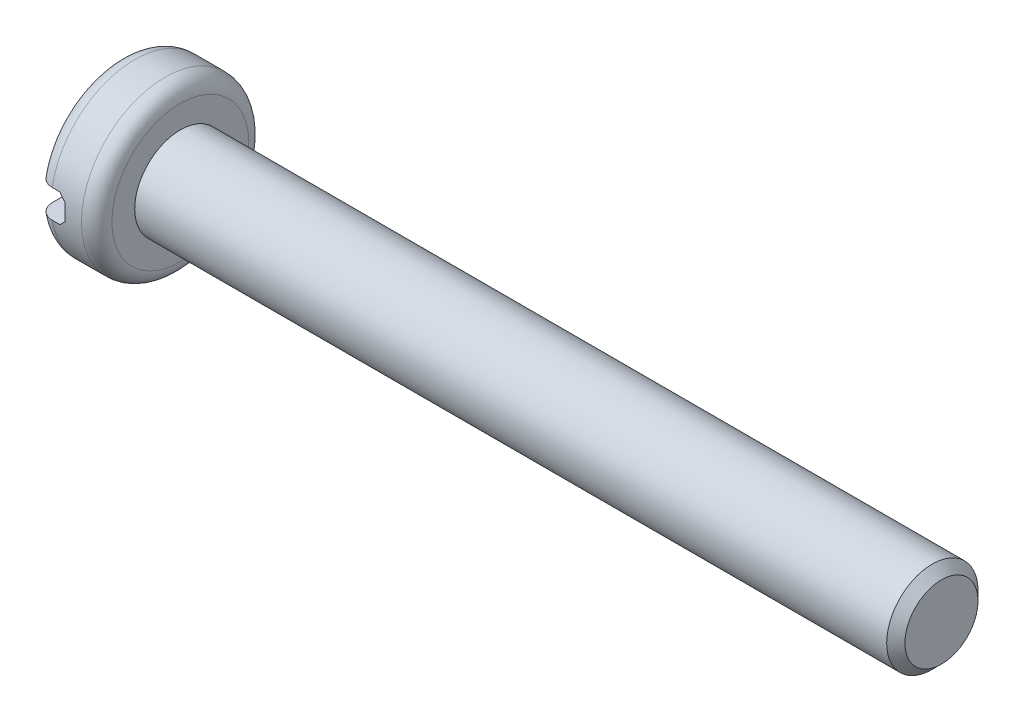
ISO-10303-21;
HEADER;
FILE_DESCRIPTION(('STEP AP214'),'2;1');
FILE_NAME('part.step','',(''),(''),'','','');
FILE_SCHEMA(('AUTOMOTIVE_DESIGN { 1 0 10303 214 1 1 1 1 }'));
ENDSEC;
DATA;
#1=APPLICATION_CONTEXT('core data for automotive mechanical design processes');
#2=APPLICATION_PROTOCOL_DEFINITION('international standard','automotive_design',2000,#1);
#3=PRODUCT_CONTEXT('',#1,'mechanical');
#4=PRODUCT('Part','Part','',(#3));
#5=PRODUCT_RELATED_PRODUCT_CATEGORY('part','',(#4));
#6=PRODUCT_DEFINITION_FORMATION('','',#4);
#7=PRODUCT_DEFINITION_CONTEXT('part definition',#1,'design');
#8=PRODUCT_DEFINITION('design','',#6,#7);
#9=PRODUCT_DEFINITION_SHAPE('','',#8);
#10=(LENGTH_UNIT() NAMED_UNIT(*) SI_UNIT(.MILLI.,.METRE.));
#11=(NAMED_UNIT(*) PLANE_ANGLE_UNIT() SI_UNIT($,.RADIAN.));
#12=(NAMED_UNIT(*) SI_UNIT($,.STERADIAN.) SOLID_ANGLE_UNIT());
#13=UNCERTAINTY_MEASURE_WITH_UNIT(LENGTH_MEASURE(1.E-05),#10,'distance_accuracy_value','');
#14=(GEOMETRIC_REPRESENTATION_CONTEXT(3) GLOBAL_UNCERTAINTY_ASSIGNED_CONTEXT((#13)) GLOBAL_UNIT_ASSIGNED_CONTEXT((#10,
#11,#12)) REPRESENTATION_CONTEXT('',''));
#15=CARTESIAN_POINT('',(0.,0.,0.));
#16=DIRECTION('',(0.,0.,1.));
#17=DIRECTION('',(1.,0.,0.));
#18=AXIS2_PLACEMENT_3D('',#15,#16,#17);
#19=CARTESIAN_POINT('',(0.,0.,0.));
#20=DIRECTION('',(1.,0.,0.));
#21=DIRECTION('',(0.,0.,-1.));
#22=AXIS2_PLACEMENT_3D('',#19,#20,#21);
#23=PLANE('',#22);
#24=DIRECTION('',(0.,0.,1.));
#25=VECTOR('',#24,1.);
#26=CARTESIAN_POINT('',(0.,0.465549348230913,-5.));
#27=LINE('',#26,#25);
#28=CARTESIAN_POINT('',(0.,0.465549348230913,-2.20130956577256));
#29=VERTEX_POINT('',#28);
#30=CARTESIAN_POINT('',(0.,0.465549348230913,2.20130956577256));
#31=VERTEX_POINT('',#30);
#32=EDGE_CURVE('E138',#29,#31,#27,.T.);
#33=ORIENTED_EDGE('',*,*,#32,.T.);
#34=CARTESIAN_POINT('',(0.,0.,0.));
#35=DIRECTION('',(1.,0.,0.));
#36=DIRECTION('',(0.,0.,-1.));
#37=AXIS2_PLACEMENT_3D('',#34,#35,#36);
#38=CIRCLE('',#37,2.25);
#39=EDGE_CURVE('E231',#31,#29,#38,.F.);
#40=ORIENTED_EDGE('',*,*,#39,.T.);
#41=EDGE_LOOP('',(#33,#40));
#42=FACE_BOUND('',#41,.T.);
#43=ADVANCED_FACE('F33',(#42),#23,.F.);
#44=DIRECTION('',(0.,0.,1.));
#45=VECTOR('',#44,1.);
#46=CARTESIAN_POINT('',(0.,-0.465549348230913,-5.));
#47=LINE('',#46,#45);
#48=CARTESIAN_POINT('',(0.,-0.465549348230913,-2.20130956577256));
#49=VERTEX_POINT('',#48);
#50=CARTESIAN_POINT('',(0.,-0.465549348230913,2.20130956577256));
#51=VERTEX_POINT('',#50);
#52=EDGE_CURVE('E124',#49,#51,#47,.T.);
#53=ORIENTED_EDGE('',*,*,#52,.F.);
#54=CARTESIAN_POINT('',(0.,0.,0.));
#55=DIRECTION('',(1.,0.,0.));
#56=DIRECTION('',(0.,0.,-1.));
#57=AXIS2_PLACEMENT_3D('',#54,#55,#56);
#58=CIRCLE('',#57,2.25);
#59=EDGE_CURVE('E180',#49,#51,#58,.F.);
#60=ORIENTED_EDGE('',*,*,#59,.T.);
#61=EDGE_LOOP('',(#53,#60));
#62=FACE_BOUND('',#61,.T.);
#63=ADVANCED_FACE('F209',(#62),#23,.F.);
#64=CARTESIAN_POINT('',(0.,0.,0.));
#65=DIRECTION('',(-1.,0.,0.));
#66=DIRECTION('',(0.,0.,1.));
#67=AXIS2_PLACEMENT_3D('',#64,#65,#66);
#68=CYLINDRICAL_SURFACE('',#67,2.75);
#69=CARTESIAN_POINT('',(1.5,0.,0.));
#70=DIRECTION('',(-1.,0.,0.));
#71=DIRECTION('',(0.,0.,1.));
#72=AXIS2_PLACEMENT_3D('',#69,#70,#71);
#73=CIRCLE('',#72,2.75);
#74=CARTESIAN_POINT('',(1.5,0.,2.75));
#75=VERTEX_POINT('',#74);
#76=EDGE_CURVE('E174',#75,#75,#73,.T.);
#77=ORIENTED_EDGE('',*,*,#76,.T.);
#78=EDGE_LOOP('',(#77));
#79=FACE_BOUND('',#78,.T.);
#80=DIRECTION('',(-1.,0.,0.));
#81=VECTOR('',#80,1.);
#82=CARTESIAN_POINT('',(0.,-0.465549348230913,2.71030695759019));
#83=LINE('',#82,#81);
#84=CARTESIAN_POINT('',(0.753445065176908,-0.465549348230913,2.71030695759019));
#85=VERTEX_POINT('',#84);
#86=CARTESIAN_POINT('',(0.5,-0.465549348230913,2.71030695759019));
#87=VERTEX_POINT('',#86);
#88=EDGE_CURVE('E103',#85,#87,#83,.T.);
#89=ORIENTED_EDGE('',*,*,#88,.T.);
#90=CARTESIAN_POINT('',(0.5,0.,0.));
#91=DIRECTION('',(1.,0.,0.));
#92=DIRECTION('',(0.,0.,-1.));
#93=AXIS2_PLACEMENT_3D('',#90,#91,#92);
#94=CIRCLE('',#93,2.75);
#95=CARTESIAN_POINT('',(0.5,-0.465549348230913,-2.71030695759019));
#96=VERTEX_POINT('',#95);
#97=EDGE_CURVE('E172',#87,#96,#94,.T.);
#98=ORIENTED_EDGE('',*,*,#97,.T.);
#99=DIRECTION('',(-1.,0.,0.));
#100=VECTOR('',#99,1.);
#101=CARTESIAN_POINT('',(0.,-0.465549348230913,-2.71030695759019));
#102=LINE('',#101,#100);
#103=CARTESIAN_POINT('',(0.753445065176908,-0.465549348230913,-2.71030695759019));
#104=VERTEX_POINT('',#103);
#105=EDGE_CURVE('E135',#96,#104,#102,.F.);
#106=ORIENTED_EDGE('',*,*,#105,.T.);
#107=CARTESIAN_POINT('',(1.21899441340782,0.,0.));
#108=DIRECTION('',(0.707106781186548,-0.707106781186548,0.));
#109=DIRECTION('',(-0.707106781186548,-0.707106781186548,0.));
#110=AXIS2_PLACEMENT_3D('',#107,#108,#109);
#111=ELLIPSE('',#110,3.88908729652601,2.75);
#112=CARTESIAN_POINT('',(0.953445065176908,-0.265549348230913,-2.7371487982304));
#113=VERTEX_POINT('',#112);
#114=EDGE_CURVE('E122',#104,#113,#111,.T.);
#115=ORIENTED_EDGE('',*,*,#114,.T.);
#116=CARTESIAN_POINT('',(0.953445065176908,0.,0.));
#117=DIRECTION('',(1.,0.,0.));
#118=DIRECTION('',(0.,0.,-1.));
#119=AXIS2_PLACEMENT_3D('',#116,#117,#118);
#120=CIRCLE('',#119,2.75);
#121=CARTESIAN_POINT('',(0.953445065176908,0.265549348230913,-2.7371487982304));
#122=VERTEX_POINT('',#121);
#123=EDGE_CURVE('E133',#113,#122,#120,.T.);
#124=ORIENTED_EDGE('',*,*,#123,.T.);
#125=CARTESIAN_POINT('',(1.21899441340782,0.,0.));
#126=DIRECTION('',(0.707106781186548,0.707106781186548,0.));
#127=DIRECTION('',(-0.707106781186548,0.707106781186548,0.));
#128=AXIS2_PLACEMENT_3D('',#125,#126,#127);
#129=ELLIPSE('',#128,3.88908729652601,2.75);
#130=CARTESIAN_POINT('',(0.753445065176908,0.465549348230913,-2.71030695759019));
#131=VERTEX_POINT('',#130);
#132=EDGE_CURVE('E137',#122,#131,#129,.T.);
#133=ORIENTED_EDGE('',*,*,#132,.T.);
#134=DIRECTION('',(-1.,0.,0.));
#135=VECTOR('',#134,1.);
#136=CARTESIAN_POINT('',(0.,0.465549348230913,-2.71030695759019));
#137=LINE('',#136,#135);
#138=CARTESIAN_POINT('',(0.5,0.465549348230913,-2.71030695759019));
#139=VERTEX_POINT('',#138);
#140=EDGE_CURVE('E115',#131,#139,#137,.T.);
#141=ORIENTED_EDGE('',*,*,#140,.T.);
#142=CARTESIAN_POINT('',(0.5,0.,0.));
#143=DIRECTION('',(1.,0.,0.));
#144=DIRECTION('',(0.,0.,-1.));
#145=AXIS2_PLACEMENT_3D('',#142,#143,#144);
#146=CIRCLE('',#145,2.75);
#147=CARTESIAN_POINT('',(0.5,0.465549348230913,2.71030695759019));
#148=VERTEX_POINT('',#147);
#149=EDGE_CURVE('E170',#139,#148,#146,.T.);
#150=ORIENTED_EDGE('',*,*,#149,.T.);
#151=DIRECTION('',(-1.,0.,0.));
#152=VECTOR('',#151,1.);
#153=CARTESIAN_POINT('',(0.,0.465549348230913,2.71030695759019));
#154=LINE('',#153,#152);
#155=CARTESIAN_POINT('',(0.753445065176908,0.465549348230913,2.71030695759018));
#156=VERTEX_POINT('',#155);
#157=EDGE_CURVE('E150',#148,#156,#154,.F.);
#158=ORIENTED_EDGE('',*,*,#157,.T.);
#159=CARTESIAN_POINT('',(0.953445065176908,0.265549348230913,2.7371487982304));
#160=VERTEX_POINT('',#159);
#161=EDGE_CURVE('E131',#156,#160,#129,.T.);
#162=ORIENTED_EDGE('',*,*,#161,.T.);
#163=CARTESIAN_POINT('',(0.953445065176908,-0.265549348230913,2.7371487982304));
#164=VERTEX_POINT('',#163);
#165=EDGE_CURVE('E129',#160,#164,#120,.T.);
#166=ORIENTED_EDGE('',*,*,#165,.T.);
#167=EDGE_CURVE('E114',#164,#85,#111,.T.);
#168=ORIENTED_EDGE('',*,*,#167,.T.);
#169=EDGE_LOOP('',(#89,#98,#106,#115,#124,#133,#141,#150,#158,#162,#166,#168));
#170=FACE_BOUND('',#169,.T.);
#171=ADVANCED_FACE('F127',(#79,#170),#68,.T.);
#172=CARTESIAN_POINT('',(2.,2.75,0.));
#173=DIRECTION('',(-1.,0.,0.));
#174=DIRECTION('',(0.,0.,1.));
#175=AXIS2_PLACEMENT_3D('',#172,#173,#174);
#176=PLANE('',#175);
#177=CARTESIAN_POINT('',(2.,0.,0.));
#178=DIRECTION('',(-1.,0.,0.));
#179=DIRECTION('',(0.,0.,1.));
#180=AXIS2_PLACEMENT_3D('',#177,#178,#179);
#181=CIRCLE('',#180,2.25);
#182=CARTESIAN_POINT('',(2.,0.,2.25));
#183=VERTEX_POINT('',#182);
#184=EDGE_CURVE('E177',#183,#183,#181,.F.);
#185=ORIENTED_EDGE('',*,*,#184,.T.);
#186=EDGE_LOOP('',(#185));
#187=FACE_BOUND('',#186,.T.);
#188=CARTESIAN_POINT('',(2.,0.,0.));
#189=DIRECTION('',(-1.,0.,0.));
#190=DIRECTION('',(0.,0.,1.));
#191=AXIS2_PLACEMENT_3D('',#188,#189,#190);
#192=CIRCLE('',#191,1.5);
#193=CARTESIAN_POINT('',(2.,0.,1.5));
#194=VERTEX_POINT('',#193);
#195=EDGE_CURVE('E159',#194,#194,#192,.F.);
#196=ORIENTED_EDGE('',*,*,#195,.F.);
#197=EDGE_LOOP('',(#196));
#198=FACE_BOUND('',#197,.T.);
#199=ADVANCED_FACE('F202',(#187,#198),#176,.F.);
#200=CARTESIAN_POINT('',(0.,0.465549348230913,-5.));
#201=DIRECTION('',(0.,1.,0.));
#202=DIRECTION('',(0.,0.,1.));
#203=AXIS2_PLACEMENT_3D('',#200,#201,#202);
#204=PLANE('',#203);
#205=ORIENTED_EDGE('',*,*,#32,.F.);
#206=CARTESIAN_POINT('',(0.,0.465549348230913,-2.20130956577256));
#207=CARTESIAN_POINT('',(-2.32271709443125E-05,0.465549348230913,-2.23036705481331));
#208=CARTESIAN_POINT('',(0.00242337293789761,0.465549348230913,-2.25942426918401));
#209=CARTESIAN_POINT('',(0.0121175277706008,0.465549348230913,-2.31672486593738));
#210=CARTESIAN_POINT('',(0.0193648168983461,0.465549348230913,-2.34496829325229));
#211=CARTESIAN_POINT('',(0.0385299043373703,0.465549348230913,-2.39985498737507));
#212=CARTESIAN_POINT('',(0.0504517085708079,0.465549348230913,-2.42649685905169));
#213=CARTESIAN_POINT('',(0.0786500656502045,0.465549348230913,-2.47735490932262));
#214=CARTESIAN_POINT('',(0.0949247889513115,0.465549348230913,-2.50157210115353));
#215=CARTESIAN_POINT('',(0.131159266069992,0.465549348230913,-2.54656669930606));
#216=CARTESIAN_POINT('',(0.151069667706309,0.465549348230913,-2.56738383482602));
#217=CARTESIAN_POINT('',(0.19416254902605,0.465549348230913,-2.60531423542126));
#218=CARTESIAN_POINT('',(0.217345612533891,0.465549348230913,-2.6224268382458));
#219=CARTESIAN_POINT('',(0.265896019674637,0.465549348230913,-2.65215361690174));
#220=CARTESIAN_POINT('',(0.291220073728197,0.465549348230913,-2.66483860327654));
#221=CARTESIAN_POINT('',(0.343649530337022,0.465549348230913,-2.68570739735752));
#222=CARTESIAN_POINT('',(0.370753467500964,0.465549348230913,-2.69389485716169));
#223=CARTESIAN_POINT('',(0.4150523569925,0.465549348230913,-2.70323223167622));
#224=CARTESIAN_POINT('',(0.431945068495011,0.465549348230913,-2.70588389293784));
#225=CARTESIAN_POINT('',(0.465889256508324,0.465549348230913,-2.70942071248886));
#226=CARTESIAN_POINT('',(0.482940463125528,0.465549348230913,-2.71030846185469));
#227=CARTESIAN_POINT('',(0.5,0.465549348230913,-2.71030695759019));
#228=B_SPLINE_CURVE_WITH_KNOTS('',3,(#206,#207,#208,#209,#210,#211,#212,#213,#214,#215,#216,
#217,#218,#219,#220,#221,#222,#223,#224,#225,#226,#227),.UNSPECIFIED.,.F.,.F.,(4,2,2,2,2,2,2,2,
2,2,4),(0.,0.0870698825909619,0.174134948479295,0.261274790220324,0.348378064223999,
0.434376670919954,0.520390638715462,0.604958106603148,0.689456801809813,0.740671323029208,
0.79181055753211),.UNSPECIFIED.);
#229=EDGE_CURVE('E11',#29,#139,#228,.T.);
#230=ORIENTED_EDGE('',*,*,#229,.T.);
#231=ORIENTED_EDGE('',*,*,#140,.F.);
#232=DIRECTION('',(0.,0.,1.));
#233=VECTOR('',#232,1.);
#234=CARTESIAN_POINT('',(0.753445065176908,0.465549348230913,-5.));
#235=LINE('',#234,#233);
#236=EDGE_CURVE('E139',#131,#156,#235,.T.);
#237=ORIENTED_EDGE('',*,*,#236,.T.);
#238=ORIENTED_EDGE('',*,*,#157,.F.);
#239=CARTESIAN_POINT('',(0.5,0.465549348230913,2.71030695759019));
#240=CARTESIAN_POINT('',(0.472181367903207,0.465549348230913,2.71033223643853));
#241=CARTESIAN_POINT('',(0.444371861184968,0.465549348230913,2.70795291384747));
#242=CARTESIAN_POINT('',(0.389574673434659,0.465549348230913,2.69857391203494));
#243=CARTESIAN_POINT('',(0.362586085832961,0.465549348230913,2.69157953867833));
#244=CARTESIAN_POINT('',(0.310157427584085,0.465549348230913,2.67315515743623));
#245=CARTESIAN_POINT('',(0.284717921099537,0.465549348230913,2.66172354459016));
#246=CARTESIAN_POINT('',(0.236107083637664,0.465549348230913,2.63477728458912));
#247=CARTESIAN_POINT('',(0.212935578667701,0.465549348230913,2.61926295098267));
#248=CARTESIAN_POINT('',(0.169367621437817,0.465549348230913,2.58451001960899));
#249=CARTESIAN_POINT('',(0.148987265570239,0.465549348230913,2.56525125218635));
#250=CARTESIAN_POINT('',(0.111692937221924,0.465549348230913,2.52362403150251));
#251=CARTESIAN_POINT('',(0.0947796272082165,0.465549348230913,2.50125498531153));
#252=CARTESIAN_POINT('',(0.0646451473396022,0.465549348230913,2.45371660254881));
#253=CARTESIAN_POINT('',(0.0514789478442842,0.465549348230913,2.42851246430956));
#254=CARTESIAN_POINT('',(0.0294866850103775,0.465549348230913,2.37627970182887));
#255=CARTESIAN_POINT('',(0.0206594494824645,0.465549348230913,2.34925157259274));
#256=CARTESIAN_POINT('',(0.00941073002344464,0.465549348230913,2.30198118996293));
#257=CARTESIAN_POINT('',(0.00588150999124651,0.465549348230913,2.28199464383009));
#258=CARTESIAN_POINT('',(0.0011762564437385,0.465549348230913,2.24177721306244));
#259=CARTESIAN_POINT('',(-3.35439816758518E-06,0.465549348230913,2.22154674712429));
#260=CARTESIAN_POINT('',(0.,0.465549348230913,2.20130956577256));
#261=B_SPLINE_CURVE_WITH_KNOTS('',3,(#239,#240,#241,#242,#243,#244,#245,#246,#247,#248,#249,
#250,#251,#252,#253,#254,#255,#256,#257,#258,#259,#260),.UNSPECIFIED.,.F.,.F.,(4,2,2,2,2,2,2,2,
2,2,4),(0.,0.0833408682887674,0.1665860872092,0.249861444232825,0.333130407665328,
0.416860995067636,0.500607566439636,0.585525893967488,0.670421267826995,0.731177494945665,
0.791841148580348),.UNSPECIFIED.);
#262=EDGE_CURVE('E46',#148,#31,#261,.T.);
#263=ORIENTED_EDGE('',*,*,#262,.T.);
#264=EDGE_LOOP('',(#205,#230,#231,#237,#238,#263));
#265=FACE_BOUND('',#264,.T.);
#266=ADVANCED_FACE('F149',(#265),#204,.F.);
#267=CARTESIAN_POINT('',(0.753445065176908,0.465549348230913,-5.));
#268=DIRECTION('',(0.707106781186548,0.707106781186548,0.));
#269=DIRECTION('',(-0.707106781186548,0.707106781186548,0.));
#270=AXIS2_PLACEMENT_3D('',#267,#268,#269);
#271=PLANE('',#270);
#272=ORIENTED_EDGE('',*,*,#236,.F.);
#273=ORIENTED_EDGE('',*,*,#132,.F.);
#274=DIRECTION('',(0.,0.,1.));
#275=VECTOR('',#274,1.);
#276=CARTESIAN_POINT('',(0.953445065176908,0.265549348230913,-5.));
#277=LINE('',#276,#275);
#278=EDGE_CURVE('E144',#122,#160,#277,.T.);
#279=ORIENTED_EDGE('',*,*,#278,.T.);
#280=ORIENTED_EDGE('',*,*,#161,.F.);
#281=EDGE_LOOP('',(#272,#273,#279,#280));
#282=FACE_BOUND('',#281,.T.);
#283=ADVANCED_FACE('F155',(#282),#271,.F.);
#284=CARTESIAN_POINT('',(0.953445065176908,0.265549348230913,-5.));
#285=DIRECTION('',(1.,0.,0.));
#286=DIRECTION('',(0.,0.,-1.));
#287=AXIS2_PLACEMENT_3D('',#284,#285,#286);
#288=PLANE('',#287);
#289=ORIENTED_EDGE('',*,*,#278,.F.);
#290=ORIENTED_EDGE('',*,*,#123,.F.);
#291=DIRECTION('',(0.,0.,1.));
#292=VECTOR('',#291,1.);
#293=CARTESIAN_POINT('',(0.953445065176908,-0.265549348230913,-5.));
#294=LINE('',#293,#292);
#295=EDGE_CURVE('E123',#113,#164,#294,.T.);
#296=ORIENTED_EDGE('',*,*,#295,.T.);
#297=ORIENTED_EDGE('',*,*,#165,.F.);
#298=EDGE_LOOP('',(#289,#290,#296,#297));
#299=FACE_BOUND('',#298,.T.);
#300=ADVANCED_FACE('F242',(#299),#288,.F.);
#301=CARTESIAN_POINT('',(0.753445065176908,-0.465549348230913,-5.));
#302=DIRECTION('',(0.707106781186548,-0.707106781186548,0.));
#303=DIRECTION('',(0.707106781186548,0.707106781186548,0.));
#304=AXIS2_PLACEMENT_3D('',#301,#302,#303);
#305=PLANE('',#304);
#306=DIRECTION('',(0.,0.,1.));
#307=VECTOR('',#306,1.);
#308=CARTESIAN_POINT('',(0.753445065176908,-0.465549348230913,-5.));
#309=LINE('',#308,#307);
#310=EDGE_CURVE('E108',#104,#85,#309,.T.);
#311=ORIENTED_EDGE('',*,*,#310,.T.);
#312=ORIENTED_EDGE('',*,*,#167,.F.);
#313=ORIENTED_EDGE('',*,*,#295,.F.);
#314=ORIENTED_EDGE('',*,*,#114,.F.);
#315=EDGE_LOOP('',(#311,#312,#313,#314));
#316=FACE_BOUND('',#315,.T.);
#317=ADVANCED_FACE('F118',(#316),#305,.F.);
#318=CARTESIAN_POINT('',(0.,-0.465549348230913,-5.));
#319=DIRECTION('',(0.,-1.,0.));
#320=DIRECTION('',(0.,0.,-1.));
#321=AXIS2_PLACEMENT_3D('',#318,#319,#320);
#322=PLANE('',#321);
#323=ORIENTED_EDGE('',*,*,#52,.T.);
#324=CARTESIAN_POINT('',(0.,-0.465549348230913,2.20130956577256));
#325=CARTESIAN_POINT('',(-2.32271709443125E-05,-0.465549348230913,2.23036705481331));
#326=CARTESIAN_POINT('',(0.00242337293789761,-0.465549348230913,2.25942426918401));
#327=CARTESIAN_POINT('',(0.0121175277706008,-0.465549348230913,2.31672486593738));
#328=CARTESIAN_POINT('',(0.0193648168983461,-0.465549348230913,2.34496829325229));
#329=CARTESIAN_POINT('',(0.0385299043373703,-0.465549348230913,2.39985498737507));
#330=CARTESIAN_POINT('',(0.0504517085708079,-0.465549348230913,2.42649685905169));
#331=CARTESIAN_POINT('',(0.0786500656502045,-0.465549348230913,2.47735490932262));
#332=CARTESIAN_POINT('',(0.0949247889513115,-0.465549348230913,2.50157210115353));
#333=CARTESIAN_POINT('',(0.131159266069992,-0.465549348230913,2.54656669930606));
#334=CARTESIAN_POINT('',(0.151069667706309,-0.465549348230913,2.56738383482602));
#335=CARTESIAN_POINT('',(0.19416254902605,-0.465549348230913,2.60531423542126));
#336=CARTESIAN_POINT('',(0.217345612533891,-0.465549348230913,2.6224268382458));
#337=CARTESIAN_POINT('',(0.265896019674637,-0.465549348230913,2.65215361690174));
#338=CARTESIAN_POINT('',(0.291220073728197,-0.465549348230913,2.66483860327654));
#339=CARTESIAN_POINT('',(0.343649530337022,-0.465549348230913,2.68570739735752));
#340=CARTESIAN_POINT('',(0.370753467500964,-0.465549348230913,2.69389485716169));
#341=CARTESIAN_POINT('',(0.4150523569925,-0.465549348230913,2.70323223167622));
#342=CARTESIAN_POINT('',(0.431945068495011,-0.465549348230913,2.70588389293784));
#343=CARTESIAN_POINT('',(0.465889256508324,-0.465549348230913,2.70942071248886));
#344=CARTESIAN_POINT('',(0.482940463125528,-0.465549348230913,2.71030846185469));
#345=CARTESIAN_POINT('',(0.5,-0.465549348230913,2.71030695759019));
#346=B_SPLINE_CURVE_WITH_KNOTS('',3,(#324,#325,#326,#327,#328,#329,#330,#331,#332,#333,#334,
#335,#336,#337,#338,#339,#340,#341,#342,#343,#344,#345),.UNSPECIFIED.,.F.,.F.,(4,2,2,2,2,2,2,2,
2,2,4),(0.,0.0870698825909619,0.174134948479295,0.261274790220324,0.348378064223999,
0.434376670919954,0.520390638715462,0.604958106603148,0.689456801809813,0.740671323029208,
0.79181055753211),.UNSPECIFIED.);
#347=EDGE_CURVE('E110',#51,#87,#346,.T.);
#348=ORIENTED_EDGE('',*,*,#347,.T.);
#349=ORIENTED_EDGE('',*,*,#88,.F.);
#350=ORIENTED_EDGE('',*,*,#310,.F.);
#351=ORIENTED_EDGE('',*,*,#105,.F.);
#352=CARTESIAN_POINT('',(0.5,-0.465549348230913,-2.71030695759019));
#353=CARTESIAN_POINT('',(0.472181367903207,-0.465549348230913,-2.71033223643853));
#354=CARTESIAN_POINT('',(0.444371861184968,-0.465549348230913,-2.70795291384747));
#355=CARTESIAN_POINT('',(0.389574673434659,-0.465549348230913,-2.69857391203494));
#356=CARTESIAN_POINT('',(0.362586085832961,-0.465549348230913,-2.69157953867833));
#357=CARTESIAN_POINT('',(0.310157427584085,-0.465549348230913,-2.67315515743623));
#358=CARTESIAN_POINT('',(0.284717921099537,-0.465549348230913,-2.66172354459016));
#359=CARTESIAN_POINT('',(0.236107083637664,-0.465549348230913,-2.63477728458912));
#360=CARTESIAN_POINT('',(0.212935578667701,-0.465549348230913,-2.61926295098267));
#361=CARTESIAN_POINT('',(0.169367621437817,-0.465549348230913,-2.58451001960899));
#362=CARTESIAN_POINT('',(0.148987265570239,-0.465549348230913,-2.56525125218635));
#363=CARTESIAN_POINT('',(0.111692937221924,-0.465549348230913,-2.52362403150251));
#364=CARTESIAN_POINT('',(0.0947796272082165,-0.465549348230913,-2.50125498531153));
#365=CARTESIAN_POINT('',(0.0646451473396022,-0.465549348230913,-2.45371660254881));
#366=CARTESIAN_POINT('',(0.0514789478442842,-0.465549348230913,-2.42851246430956));
#367=CARTESIAN_POINT('',(0.0294866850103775,-0.465549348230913,-2.37627970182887));
#368=CARTESIAN_POINT('',(0.0206594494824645,-0.465549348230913,-2.34925157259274));
#369=CARTESIAN_POINT('',(0.00941073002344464,-0.465549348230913,-2.30198118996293));
#370=CARTESIAN_POINT('',(0.00588150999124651,-0.465549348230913,-2.28199464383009));
#371=CARTESIAN_POINT('',(0.0011762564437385,-0.465549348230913,-2.24177721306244));
#372=CARTESIAN_POINT('',(-3.35439816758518E-06,-0.465549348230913,-2.22154674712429));
#373=CARTESIAN_POINT('',(0.,-0.465549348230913,-2.20130956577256));
#374=B_SPLINE_CURVE_WITH_KNOTS('',3,(#352,#353,#354,#355,#356,#357,#358,#359,#360,#361,#362,
#363,#364,#365,#366,#367,#368,#369,#370,#371,#372,#373),.UNSPECIFIED.,.F.,.F.,(4,2,2,2,2,2,2,2,
2,2,4),(0.,0.0833408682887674,0.1665860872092,0.249861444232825,0.333130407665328,
0.416860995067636,0.500607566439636,0.585525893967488,0.670421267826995,0.731177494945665,
0.791841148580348),.UNSPECIFIED.);
#375=EDGE_CURVE('E183',#96,#49,#374,.T.);
#376=ORIENTED_EDGE('',*,*,#375,.T.);
#377=EDGE_LOOP('',(#323,#348,#349,#350,#351,#376));
#378=FACE_BOUND('',#377,.T.);
#379=ADVANCED_FACE('F106',(#378),#322,.F.);
#380=CARTESIAN_POINT('',(27.,0.,0.));
#381=DIRECTION('',(-1.,0.,0.));
#382=DIRECTION('',(0.,0.,1.));
#383=AXIS2_PLACEMENT_3D('',#380,#381,#382);
#384=CYLINDRICAL_SURFACE('',#383,1.5);
#385=CARTESIAN_POINT('',(26.7,0.,0.));
#386=DIRECTION('',(1.,0.,0.));
#387=DIRECTION('',(0.,0.,-1.));
#388=AXIS2_PLACEMENT_3D('',#385,#386,#387);
#389=CIRCLE('',#388,1.5);
#390=CARTESIAN_POINT('',(26.7,0.,1.5));
#391=VERTEX_POINT('',#390);
#392=EDGE_CURVE('E167',#391,#391,#389,.F.);
#393=ORIENTED_EDGE('',*,*,#392,.T.);
#394=EDGE_LOOP('',(#393));
#395=FACE_BOUND('',#394,.T.);
#396=ORIENTED_EDGE('',*,*,#195,.T.);
#397=EDGE_LOOP('',(#396));
#398=FACE_BOUND('',#397,.T.);
#399=ADVANCED_FACE('F200',(#395,#398),#384,.T.);
#400=CARTESIAN_POINT('',(27.,0.,0.));
#401=DIRECTION('',(1.,0.,0.));
#402=DIRECTION('',(0.,0.,-1.));
#403=AXIS2_PLACEMENT_3D('',#400,#401,#402);
#404=PLANE('',#403);
#405=CARTESIAN_POINT('',(27.,0.,0.));
#406=DIRECTION('',(1.,0.,0.));
#407=DIRECTION('',(0.,0.,-1.));
#408=AXIS2_PLACEMENT_3D('',#405,#406,#407);
#409=CIRCLE('',#408,1.2);
#410=CARTESIAN_POINT('',(27.,0.,1.2));
#411=VERTEX_POINT('',#410);
#412=EDGE_CURVE('E162',#411,#411,#409,.T.);
#413=ORIENTED_EDGE('',*,*,#412,.T.);
#414=EDGE_LOOP('',(#413));
#415=FACE_BOUND('',#414,.T.);
#416=ADVANCED_FACE('F217',(#415),#404,.T.);
#417=CARTESIAN_POINT('',(27.,0.,0.));
#418=DIRECTION('',(-1.,0.,0.));
#419=DIRECTION('',(0.,0.,1.));
#420=AXIS2_PLACEMENT_3D('',#417,#418,#419);
#421=CONICAL_SURFACE('',#420,1.2,0.785398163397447);
#422=CARTESIAN_POINT('',(26.7,0.,1.5));
#423=CARTESIAN_POINT('',(26.703125,0.,1.496875));
#424=CARTESIAN_POINT('',(26.70625,0.,1.49375));
#425=CARTESIAN_POINT('',(26.7125,0.,1.4875));
#426=CARTESIAN_POINT('',(26.715625,0.,1.484375));
#427=CARTESIAN_POINT('',(26.721875,0.,1.478125));
#428=CARTESIAN_POINT('',(26.725,0.,1.475));
#429=CARTESIAN_POINT('',(26.73125,0.,1.46875));
#430=CARTESIAN_POINT('',(26.734375,0.,1.465625));
#431=CARTESIAN_POINT('',(26.740625,0.,1.459375));
#432=CARTESIAN_POINT('',(26.74375,0.,1.45625));
#433=CARTESIAN_POINT('',(26.75,0.,1.45));
#434=CARTESIAN_POINT('',(26.753125,0.,1.446875));
#435=CARTESIAN_POINT('',(26.759375,0.,1.440625));
#436=CARTESIAN_POINT('',(26.7625,0.,1.4375));
#437=CARTESIAN_POINT('',(26.76875,0.,1.43125));
#438=CARTESIAN_POINT('',(26.771875,0.,1.428125));
#439=CARTESIAN_POINT('',(26.778125,0.,1.421875));
#440=CARTESIAN_POINT('',(26.78125,0.,1.41875));
#441=CARTESIAN_POINT('',(26.7875,0.,1.4125));
#442=CARTESIAN_POINT('',(26.790625,0.,1.409375));
#443=CARTESIAN_POINT('',(26.796875,0.,1.403125));
#444=CARTESIAN_POINT('',(26.8,0.,1.4));
#445=CARTESIAN_POINT('',(26.80625,0.,1.39375));
#446=CARTESIAN_POINT('',(26.809375,0.,1.390625));
#447=CARTESIAN_POINT('',(26.815625,0.,1.384375));
#448=CARTESIAN_POINT('',(26.81875,0.,1.38125));
#449=CARTESIAN_POINT('',(26.825,0.,1.375));
#450=CARTESIAN_POINT('',(26.828125,0.,1.371875));
#451=CARTESIAN_POINT('',(26.834375,0.,1.365625));
#452=CARTESIAN_POINT('',(26.8375,0.,1.3625));
#453=CARTESIAN_POINT('',(26.84375,0.,1.35625));
#454=CARTESIAN_POINT('',(26.846875,0.,1.353125));
#455=CARTESIAN_POINT('',(26.853125,0.,1.346875));
#456=CARTESIAN_POINT('',(26.85625,0.,1.34375));
#457=CARTESIAN_POINT('',(26.8625,0.,1.3375));
#458=CARTESIAN_POINT('',(26.865625,0.,1.334375));
#459=CARTESIAN_POINT('',(26.871875,0.,1.328125));
#460=CARTESIAN_POINT('',(26.875,0.,1.325));
#461=CARTESIAN_POINT('',(26.88125,0.,1.31875));
#462=CARTESIAN_POINT('',(26.884375,0.,1.315625));
#463=CARTESIAN_POINT('',(26.890625,0.,1.309375));
#464=CARTESIAN_POINT('',(26.89375,0.,1.30625));
#465=CARTESIAN_POINT('',(26.9,0.,1.3));
#466=CARTESIAN_POINT('',(26.903125,0.,1.296875));
#467=CARTESIAN_POINT('',(26.909375,0.,1.290625));
#468=CARTESIAN_POINT('',(26.9125,0.,1.2875));
#469=CARTESIAN_POINT('',(26.91875,0.,1.28125));
#470=CARTESIAN_POINT('',(26.921875,0.,1.278125));
#471=CARTESIAN_POINT('',(26.928125,0.,1.271875));
#472=CARTESIAN_POINT('',(26.93125,0.,1.26875));
#473=CARTESIAN_POINT('',(26.9375,0.,1.2625));
#474=CARTESIAN_POINT('',(26.940625,0.,1.259375));
#475=CARTESIAN_POINT('',(26.946875,0.,1.253125));
#476=CARTESIAN_POINT('',(26.95,0.,1.25));
#477=CARTESIAN_POINT('',(26.95625,0.,1.24375));
#478=CARTESIAN_POINT('',(26.959375,0.,1.240625));
#479=CARTESIAN_POINT('',(26.965625,0.,1.234375));
#480=CARTESIAN_POINT('',(26.96875,0.,1.23125));
#481=CARTESIAN_POINT('',(26.975,0.,1.225));
#482=CARTESIAN_POINT('',(26.978125,0.,1.221875));
#483=CARTESIAN_POINT('',(26.984375,0.,1.215625));
#484=CARTESIAN_POINT('',(26.9875,0.,1.2125));
#485=CARTESIAN_POINT('',(26.99375,0.,1.20625));
#486=CARTESIAN_POINT('',(26.996875,0.,1.203125));
#487=CARTESIAN_POINT('',(27.,0.,1.2));
#488=B_SPLINE_CURVE_WITH_KNOTS('',3,(#422,#423,#424,#425,#426,#427,#428,#429,#430,#431,#432,
#433,#434,#435,#436,#437,#438,#439,#440,#441,#442,#443,#444,#445,#446,#447,#448,#449,#450,#451,
#452,#453,#454,#455,#456,#457,#458,#459,#460,#461,#462,#463,#464,#465,#466,#467,#468,#469,#470,
#471,#472,#473,#474,#475,#476,#477,#478,#479,#480,#481,#482,#483,#484,#485,#486,#487),
.UNSPECIFIED.,.F.,.F.,(4,2,2,2,2,2,2,2,2,2,2,2,2,2,2,2,2,2,2,2,2,2,2,2,2,2,2,2,2,2,2,2,4),(0.,
0.0132582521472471,0.0265165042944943,0.0397747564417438,0.0530330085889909,0.0662912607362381,
0.0795495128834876,0.0928077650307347,0.106066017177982,0.119324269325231,0.132582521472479,
0.145840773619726,0.159099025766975,0.172357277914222,0.18561553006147,0.198873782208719,
0.212132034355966,0.225390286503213,0.238648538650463,0.25190679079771,0.265165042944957,
0.278423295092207,0.291681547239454,0.304939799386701,0.318198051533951,0.331456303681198,
0.344714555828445,0.357972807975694,0.371231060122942,0.384489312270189,0.397747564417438,
0.411005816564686,0.424264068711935),.UNSPECIFIED.);
#489=EDGE_CURVE('BSEAM214',#391,#411,#488,.T.);
#490=ORIENTED_EDGE('',*,*,#392,.F.);
#491=ORIENTED_EDGE('',*,*,#412,.F.);
#492=ORIENTED_EDGE('',*,*,#489,.T.);
#493=ORIENTED_EDGE('',*,*,#489,.F.);
#494=EDGE_LOOP('',(#490,#492,#491,#493));
#495=FACE_BOUND('',#494,.T.);
#496=ADVANCED_FACE('F214',(#495),#421,.T.);
#497=CARTESIAN_POINT('',(1.5,0.,0.));
#498=DIRECTION('',(-1.,0.,0.));
#499=DIRECTION('',(0.,0.,1.));
#500=AXIS2_PLACEMENT_3D('',#497,#498,#499);
#501=TOROIDAL_SURFACE('',#500,2.25,0.5);
#502=ORIENTED_EDGE('',*,*,#184,.F.);
#503=EDGE_LOOP('',(#502));
#504=FACE_BOUND('',#503,.T.);
#505=ORIENTED_EDGE('',*,*,#76,.F.);
#506=EDGE_LOOP('',(#505));
#507=FACE_BOUND('',#506,.T.);
#508=ADVANCED_FACE('F216',(#504,#507),#501,.T.);
#509=CARTESIAN_POINT('',(0.5,0.,0.));
#510=DIRECTION('',(1.,0.,0.));
#511=DIRECTION('',(0.,0.,-1.));
#512=AXIS2_PLACEMENT_3D('',#509,#510,#511);
#513=TOROIDAL_SURFACE('',#512,2.25,0.5);
#514=ORIENTED_EDGE('',*,*,#375,.F.);
#515=ORIENTED_EDGE('',*,*,#97,.F.);
#516=ORIENTED_EDGE('',*,*,#347,.F.);
#517=ORIENTED_EDGE('',*,*,#59,.F.);
#518=EDGE_LOOP('',(#514,#515,#516,#517));
#519=FACE_BOUND('',#518,.T.);
#520=ADVANCED_FACE('F193',(#519),#513,.T.);
#521=CARTESIAN_POINT('',(0.5,0.,0.));
#522=DIRECTION('',(1.,0.,0.));
#523=DIRECTION('',(0.,0.,-1.));
#524=AXIS2_PLACEMENT_3D('',#521,#522,#523);
#525=TOROIDAL_SURFACE('',#524,2.25,0.5);
#526=ORIENTED_EDGE('',*,*,#262,.F.);
#527=ORIENTED_EDGE('',*,*,#149,.F.);
#528=ORIENTED_EDGE('',*,*,#229,.F.);
#529=ORIENTED_EDGE('',*,*,#39,.F.);
#530=EDGE_LOOP('',(#526,#527,#528,#529));
#531=FACE_BOUND('',#530,.T.);
#532=ADVANCED_FACE('F35',(#531),#525,.T.);
#533=CLOSED_SHELL('',(#43,#63,#171,#199,#266,#283,#300,#317,#379,#399,#416,#496,#508,#520,#532));
#534=MANIFOLD_SOLID_BREP('B2',#533);
#535=ADVANCED_BREP_SHAPE_REPRESENTATION('',(#18,#534),#14);
#536=SHAPE_DEFINITION_REPRESENTATION(#9,#535);
ENDSEC;
END-ISO-10303-21;
